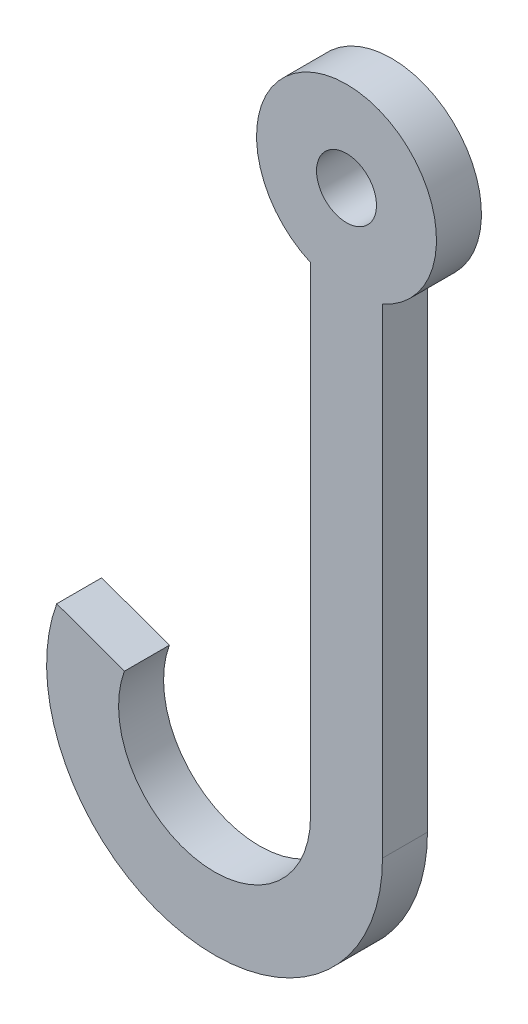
ISO-10303-21;
HEADER;
FILE_DESCRIPTION(('STEP AP214'),'2;1');
FILE_NAME('part.step','',(''),(''),'','','');
FILE_SCHEMA(('AUTOMOTIVE_DESIGN { 1 0 10303 214 1 1 1 1 }'));
ENDSEC;
DATA;
#1=APPLICATION_CONTEXT('core data for automotive mechanical design processes');
#2=APPLICATION_PROTOCOL_DEFINITION('international standard','automotive_design',2000,#1);
#3=PRODUCT_CONTEXT('',#1,'mechanical');
#4=PRODUCT('Part','Part','',(#3));
#5=PRODUCT_RELATED_PRODUCT_CATEGORY('part','',(#4));
#6=PRODUCT_DEFINITION_FORMATION('','',#4);
#7=PRODUCT_DEFINITION_CONTEXT('part definition',#1,'design');
#8=PRODUCT_DEFINITION('design','',#6,#7);
#9=PRODUCT_DEFINITION_SHAPE('','',#8);
#10=(LENGTH_UNIT() NAMED_UNIT(*) SI_UNIT(.MILLI.,.METRE.));
#11=(NAMED_UNIT(*) PLANE_ANGLE_UNIT() SI_UNIT($,.RADIAN.));
#12=(NAMED_UNIT(*) SI_UNIT($,.STERADIAN.) SOLID_ANGLE_UNIT());
#13=UNCERTAINTY_MEASURE_WITH_UNIT(LENGTH_MEASURE(1.E-05),#10,'distance_accuracy_value','');
#14=(GEOMETRIC_REPRESENTATION_CONTEXT(3) GLOBAL_UNCERTAINTY_ASSIGNED_CONTEXT((#13)) GLOBAL_UNIT_ASSIGNED_CONTEXT((#10,
#11,#12)) REPRESENTATION_CONTEXT('',''));
#15=CARTESIAN_POINT('',(0.,0.,0.));
#16=DIRECTION('',(0.,0.,1.));
#17=DIRECTION('',(1.,0.,0.));
#18=AXIS2_PLACEMENT_3D('',#15,#16,#17);
#19=CARTESIAN_POINT('',(0.,0.,4.7625));
#20=DIRECTION('',(0.,0.,1.));
#21=DIRECTION('',(1.,0.,0.));
#22=AXIS2_PLACEMENT_3D('',#19,#20,#21);
#23=PLANE('',#22);
#24=CARTESIAN_POINT('',(0.,0.,4.7625));
#25=DIRECTION('',(0.,0.,1.));
#26=DIRECTION('',(1.,0.,0.));
#27=AXIS2_PLACEMENT_3D('',#24,#25,#26);
#28=CIRCLE('',#27,9.525);
#29=CARTESIAN_POINT('',(3.81,-8.72980669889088,4.7625));
#30=VERTEX_POINT('',#29);
#31=CARTESIAN_POINT('',(-3.81,-8.72980669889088,4.7625));
#32=VERTEX_POINT('',#31);
#33=EDGE_CURVE('E133',#30,#32,#28,.T.);
#34=ORIENTED_EDGE('',*,*,#33,.T.);
#35=DIRECTION('',(0.,-1.,0.));
#36=VECTOR('',#35,1.);
#37=CARTESIAN_POINT('',(-3.81,-8.72980669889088,4.7625));
#38=LINE('',#37,#36);
#39=CARTESIAN_POINT('',(-3.81000000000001,-59.5298066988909,4.7625));
#40=VERTEX_POINT('',#39);
#41=EDGE_CURVE('E91',#32,#40,#38,.T.);
#42=ORIENTED_EDGE('',*,*,#41,.T.);
#43=CARTESIAN_POINT('',(-13.97,-59.5298066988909,4.7625));
#44=DIRECTION('',(0.,0.,-1.));
#45=DIRECTION('',(-1.,0.,0.));
#46=AXIS2_PLACEMENT_3D('',#43,#44,#45);
#47=CIRCLE('',#46,10.16);
#48=CARTESIAN_POINT('',(-23.5172770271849,-56.0548820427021,4.7625));
#49=VERTEX_POINT('',#48);
#50=EDGE_CURVE('E104',#40,#49,#47,.T.);
#51=ORIENTED_EDGE('',*,*,#50,.T.);
#52=DIRECTION('',(-0.939692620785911,0.342020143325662,0.));
#53=VECTOR('',#52,1.);
#54=CARTESIAN_POINT('',(-23.5172770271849,-56.0548820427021,4.7625));
#55=LINE('',#54,#53);
#56=CARTESIAN_POINT('',(-30.6777347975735,-53.4486885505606,4.7625));
#57=VERTEX_POINT('',#56);
#58=EDGE_CURVE('E98',#49,#57,#55,.T.);
#59=ORIENTED_EDGE('',*,*,#58,.T.);
#60=CARTESIAN_POINT('',(-13.97,-59.5298066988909,4.7625));
#61=DIRECTION('',(0.,0.,1.));
#62=DIRECTION('',(1.,0.,0.));
#63=AXIS2_PLACEMENT_3D('',#60,#61,#62);
#64=CIRCLE('',#63,17.78);
#65=CARTESIAN_POINT('',(3.81000000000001,-59.5298066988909,4.7625));
#66=VERTEX_POINT('',#65);
#67=EDGE_CURVE('E102',#57,#66,#64,.T.);
#68=ORIENTED_EDGE('',*,*,#67,.T.);
#69=DIRECTION('',(0.,1.,0.));
#70=VECTOR('',#69,1.);
#71=CARTESIAN_POINT('',(3.81,-8.72980669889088,4.7625));
#72=LINE('',#71,#70);
#73=EDGE_CURVE('E54',#66,#30,#72,.T.);
#74=ORIENTED_EDGE('',*,*,#73,.T.);
#75=EDGE_LOOP('',(#34,#42,#51,#59,#68,#74));
#76=FACE_BOUND('',#75,.T.);
#77=CARTESIAN_POINT('',(0.,0.,4.7625));
#78=DIRECTION('',(0.,0.,1.));
#79=DIRECTION('',(1.,0.,0.));
#80=AXIS2_PLACEMENT_3D('',#77,#78,#79);
#81=CIRCLE('',#80,3.175);
#82=CARTESIAN_POINT('',(-3.175,0.,4.7625));
#83=VERTEX_POINT('',#82);
#84=EDGE_CURVE('E126',#83,#83,#81,.T.);
#85=ORIENTED_EDGE('',*,*,#84,.F.);
#86=EDGE_LOOP('',(#85));
#87=FACE_BOUND('',#86,.T.);
#88=ADVANCED_FACE('F37',(#76,#87),#23,.T.);
#89=CARTESIAN_POINT('',(0.,0.,0.));
#90=DIRECTION('',(0.,0.,1.));
#91=DIRECTION('',(1.,0.,0.));
#92=AXIS2_PLACEMENT_3D('',#89,#90,#91);
#93=PLANE('',#92);
#94=CARTESIAN_POINT('',(0.,0.,0.));
#95=DIRECTION('',(0.,0.,1.));
#96=DIRECTION('',(1.,0.,0.));
#97=AXIS2_PLACEMENT_3D('',#94,#95,#96);
#98=CIRCLE('',#97,9.525);
#99=CARTESIAN_POINT('',(3.81,-8.72980669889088,0.));
#100=VERTEX_POINT('',#99);
#101=CARTESIAN_POINT('',(-3.81,-8.72980669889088,0.));
#102=VERTEX_POINT('',#101);
#103=EDGE_CURVE('E122',#100,#102,#98,.T.);
#104=ORIENTED_EDGE('',*,*,#103,.F.);
#105=DIRECTION('',(0.,1.,0.));
#106=VECTOR('',#105,1.);
#107=CARTESIAN_POINT('',(3.81,-8.72980669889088,0.));
#108=LINE('',#107,#106);
#109=CARTESIAN_POINT('',(3.81000000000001,-59.5298066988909,0.));
#110=VERTEX_POINT('',#109);
#111=EDGE_CURVE('E83',#110,#100,#108,.T.);
#112=ORIENTED_EDGE('',*,*,#111,.F.);
#113=CARTESIAN_POINT('',(-13.97,-59.5298066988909,0.));
#114=DIRECTION('',(0.,0.,1.));
#115=DIRECTION('',(1.,0.,0.));
#116=AXIS2_PLACEMENT_3D('',#113,#114,#115);
#117=CIRCLE('',#116,17.78);
#118=CARTESIAN_POINT('',(-30.6777347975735,-53.4486885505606,0.));
#119=VERTEX_POINT('',#118);
#120=EDGE_CURVE('E77',#119,#110,#117,.T.);
#121=ORIENTED_EDGE('',*,*,#120,.F.);
#122=DIRECTION('',(-0.939692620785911,0.342020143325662,0.));
#123=VECTOR('',#122,1.);
#124=CARTESIAN_POINT('',(-23.5172770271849,-56.0548820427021,0.));
#125=LINE('',#124,#123);
#126=CARTESIAN_POINT('',(-23.5172770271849,-56.0548820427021,0.));
#127=VERTEX_POINT('',#126);
#128=EDGE_CURVE('E112',#127,#119,#125,.T.);
#129=ORIENTED_EDGE('',*,*,#128,.F.);
#130=CARTESIAN_POINT('',(-13.97,-59.5298066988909,0.));
#131=DIRECTION('',(0.,0.,-1.));
#132=DIRECTION('',(-1.,0.,0.));
#133=AXIS2_PLACEMENT_3D('',#130,#131,#132);
#134=CIRCLE('',#133,10.16);
#135=CARTESIAN_POINT('',(-3.81000000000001,-59.5298066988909,0.));
#136=VERTEX_POINT('',#135);
#137=EDGE_CURVE('E128',#136,#127,#134,.T.);
#138=ORIENTED_EDGE('',*,*,#137,.F.);
#139=DIRECTION('',(0.,-1.,0.));
#140=VECTOR('',#139,1.);
#141=CARTESIAN_POINT('',(-3.81,-8.72980669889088,0.));
#142=LINE('',#141,#140);
#143=EDGE_CURVE('E125',#102,#136,#142,.T.);
#144=ORIENTED_EDGE('',*,*,#143,.F.);
#145=EDGE_LOOP('',(#104,#112,#121,#129,#138,#144));
#146=FACE_BOUND('',#145,.T.);
#147=CARTESIAN_POINT('',(0.,0.,0.));
#148=DIRECTION('',(0.,0.,1.));
#149=DIRECTION('',(1.,0.,0.));
#150=AXIS2_PLACEMENT_3D('',#147,#148,#149);
#151=CIRCLE('',#150,3.175);
#152=CARTESIAN_POINT('',(-3.175,0.,0.));
#153=VERTEX_POINT('',#152);
#154=EDGE_CURVE('E226',#153,#153,#151,.T.);
#155=ORIENTED_EDGE('',*,*,#154,.T.);
#156=EDGE_LOOP('',(#155));
#157=FACE_BOUND('',#156,.T.);
#158=ADVANCED_FACE('F142',(#146,#157),#93,.F.);
#159=CARTESIAN_POINT('',(0.,0.,4.7625));
#160=DIRECTION('',(0.,0.,-1.));
#161=DIRECTION('',(-1.,0.,0.));
#162=AXIS2_PLACEMENT_3D('',#159,#160,#161);
#163=CYLINDRICAL_SURFACE('',#162,9.525);
#164=ORIENTED_EDGE('',*,*,#103,.T.);
#165=DIRECTION('',(0.,0.,-1.));
#166=VECTOR('',#165,1.);
#167=CARTESIAN_POINT('',(-3.81,-8.72980669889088,4.7625));
#168=LINE('',#167,#166);
#169=EDGE_CURVE('E11',#32,#102,#168,.T.);
#170=ORIENTED_EDGE('',*,*,#169,.F.);
#171=ORIENTED_EDGE('',*,*,#33,.F.);
#172=DIRECTION('',(0.,0.,-1.));
#173=VECTOR('',#172,1.);
#174=CARTESIAN_POINT('',(3.81,-8.72980669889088,4.7625));
#175=LINE('',#174,#173);
#176=EDGE_CURVE('E118',#30,#100,#175,.T.);
#177=ORIENTED_EDGE('',*,*,#176,.T.);
#178=EDGE_LOOP('',(#164,#170,#171,#177));
#179=FACE_BOUND('',#178,.T.);
#180=ADVANCED_FACE('F39',(#179),#163,.T.);
#181=CARTESIAN_POINT('',(-3.81,-8.72980669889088,4.7625));
#182=DIRECTION('',(1.,0.,0.));
#183=DIRECTION('',(0.,1.,0.));
#184=AXIS2_PLACEMENT_3D('',#181,#182,#183);
#185=PLANE('',#184);
#186=ORIENTED_EDGE('',*,*,#143,.T.);
#187=DIRECTION('',(0.,0.,-1.));
#188=VECTOR('',#187,1.);
#189=CARTESIAN_POINT('',(-3.81000000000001,-59.5298066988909,4.7625));
#190=LINE('',#189,#188);
#191=EDGE_CURVE('E46',#40,#136,#190,.T.);
#192=ORIENTED_EDGE('',*,*,#191,.F.);
#193=ORIENTED_EDGE('',*,*,#41,.F.);
#194=ORIENTED_EDGE('',*,*,#169,.T.);
#195=EDGE_LOOP('',(#186,#192,#193,#194));
#196=FACE_BOUND('',#195,.T.);
#197=ADVANCED_FACE('F167',(#196),#185,.F.);
#198=CARTESIAN_POINT('',(-13.97,-59.5298066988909,4.7625));
#199=DIRECTION('',(0.,0.,-1.));
#200=DIRECTION('',(-1.,0.,0.));
#201=AXIS2_PLACEMENT_3D('',#198,#199,#200);
#202=CYLINDRICAL_SURFACE('',#201,10.16);
#203=ORIENTED_EDGE('',*,*,#137,.T.);
#204=DIRECTION('',(0.,0.,-1.));
#205=VECTOR('',#204,1.);
#206=CARTESIAN_POINT('',(-23.5172770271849,-56.0548820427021,4.7625));
#207=LINE('',#206,#205);
#208=EDGE_CURVE('E113',#49,#127,#207,.T.);
#209=ORIENTED_EDGE('',*,*,#208,.F.);
#210=ORIENTED_EDGE('',*,*,#50,.F.);
#211=ORIENTED_EDGE('',*,*,#191,.T.);
#212=EDGE_LOOP('',(#203,#209,#210,#211));
#213=FACE_BOUND('',#212,.T.);
#214=ADVANCED_FACE('F139',(#213),#202,.F.);
#215=CARTESIAN_POINT('',(-23.5172770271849,-56.0548820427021,4.7625));
#216=DIRECTION('',(-0.342020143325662,-0.939692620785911,0.));
#217=DIRECTION('',(0.939692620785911,-0.342020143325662,0.));
#218=AXIS2_PLACEMENT_3D('',#215,#216,#217);
#219=PLANE('',#218);
#220=ORIENTED_EDGE('',*,*,#128,.T.);
#221=DIRECTION('',(0.,0.,-1.));
#222=VECTOR('',#221,1.);
#223=CARTESIAN_POINT('',(-30.6777347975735,-53.4486885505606,4.7625));
#224=LINE('',#223,#222);
#225=EDGE_CURVE('E109',#57,#119,#224,.T.);
#226=ORIENTED_EDGE('',*,*,#225,.F.);
#227=ORIENTED_EDGE('',*,*,#58,.F.);
#228=ORIENTED_EDGE('',*,*,#208,.T.);
#229=EDGE_LOOP('',(#220,#226,#227,#228));
#230=FACE_BOUND('',#229,.T.);
#231=ADVANCED_FACE('F110',(#230),#219,.F.);
#232=CARTESIAN_POINT('',(-13.97,-59.5298066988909,4.7625));
#233=DIRECTION('',(0.,0.,-1.));
#234=DIRECTION('',(-1.,0.,0.));
#235=AXIS2_PLACEMENT_3D('',#232,#233,#234);
#236=CYLINDRICAL_SURFACE('',#235,17.78);
#237=ORIENTED_EDGE('',*,*,#120,.T.);
#238=DIRECTION('',(0.,0.,-1.));
#239=VECTOR('',#238,1.);
#240=CARTESIAN_POINT('',(3.81000000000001,-59.5298066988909,4.7625));
#241=LINE('',#240,#239);
#242=EDGE_CURVE('E114',#66,#110,#241,.T.);
#243=ORIENTED_EDGE('',*,*,#242,.F.);
#244=ORIENTED_EDGE('',*,*,#67,.F.);
#245=ORIENTED_EDGE('',*,*,#225,.T.);
#246=EDGE_LOOP('',(#237,#243,#244,#245));
#247=FACE_BOUND('',#246,.T.);
#248=ADVANCED_FACE('F116',(#247),#236,.T.);
#249=CARTESIAN_POINT('',(3.81,-8.72980669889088,4.7625));
#250=DIRECTION('',(-1.,0.,0.));
#251=DIRECTION('',(0.,-1.,0.));
#252=AXIS2_PLACEMENT_3D('',#249,#250,#251);
#253=PLANE('',#252);
#254=ORIENTED_EDGE('',*,*,#111,.T.);
#255=ORIENTED_EDGE('',*,*,#176,.F.);
#256=ORIENTED_EDGE('',*,*,#73,.F.);
#257=ORIENTED_EDGE('',*,*,#242,.T.);
#258=EDGE_LOOP('',(#254,#255,#256,#257));
#259=FACE_BOUND('',#258,.T.);
#260=ADVANCED_FACE('F147',(#259),#253,.F.);
#261=CARTESIAN_POINT('',(0.,0.,4.7625));
#262=DIRECTION('',(0.,0.,-1.));
#263=DIRECTION('',(-1.,0.,0.));
#264=AXIS2_PLACEMENT_3D('',#261,#262,#263);
#265=CYLINDRICAL_SURFACE('',#264,3.175);
#266=CARTESIAN_POINT('',(-3.175,0.,4.7625));
#267=CARTESIAN_POINT('',(-3.175,0.,4.712890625));
#268=CARTESIAN_POINT('',(-3.175,0.,4.66328125));
#269=CARTESIAN_POINT('',(-3.175,0.,4.5640625));
#270=CARTESIAN_POINT('',(-3.175,0.,4.514453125));
#271=CARTESIAN_POINT('',(-3.175,0.,4.415234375));
#272=CARTESIAN_POINT('',(-3.175,0.,4.365625));
#273=CARTESIAN_POINT('',(-3.175,0.,4.26640625));
#274=CARTESIAN_POINT('',(-3.175,0.,4.216796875));
#275=CARTESIAN_POINT('',(-3.175,0.,4.117578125));
#276=CARTESIAN_POINT('',(-3.175,0.,4.06796875));
#277=CARTESIAN_POINT('',(-3.175,0.,3.96875));
#278=CARTESIAN_POINT('',(-3.175,0.,3.919140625));
#279=CARTESIAN_POINT('',(-3.175,0.,3.819921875));
#280=CARTESIAN_POINT('',(-3.175,0.,3.7703125));
#281=CARTESIAN_POINT('',(-3.175,0.,3.67109375));
#282=CARTESIAN_POINT('',(-3.175,0.,3.621484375));
#283=CARTESIAN_POINT('',(-3.175,0.,3.522265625));
#284=CARTESIAN_POINT('',(-3.175,0.,3.47265625));
#285=CARTESIAN_POINT('',(-3.175,0.,3.3734375));
#286=CARTESIAN_POINT('',(-3.175,0.,3.323828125));
#287=CARTESIAN_POINT('',(-3.175,0.,3.224609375));
#288=CARTESIAN_POINT('',(-3.175,0.,3.175));
#289=CARTESIAN_POINT('',(-3.175,0.,3.07578125));
#290=CARTESIAN_POINT('',(-3.175,0.,3.026171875));
#291=CARTESIAN_POINT('',(-3.175,0.,2.926953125));
#292=CARTESIAN_POINT('',(-3.175,0.,2.87734375));
#293=CARTESIAN_POINT('',(-3.175,0.,2.778125));
#294=CARTESIAN_POINT('',(-3.175,0.,2.728515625));
#295=CARTESIAN_POINT('',(-3.175,0.,2.629296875));
#296=CARTESIAN_POINT('',(-3.175,0.,2.5796875));
#297=CARTESIAN_POINT('',(-3.175,0.,2.48046875));
#298=CARTESIAN_POINT('',(-3.175,0.,2.430859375));
#299=CARTESIAN_POINT('',(-3.175,0.,2.331640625));
#300=CARTESIAN_POINT('',(-3.175,0.,2.28203125));
#301=CARTESIAN_POINT('',(-3.175,0.,2.1828125));
#302=CARTESIAN_POINT('',(-3.175,0.,2.133203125));
#303=CARTESIAN_POINT('',(-3.175,0.,2.033984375));
#304=CARTESIAN_POINT('',(-3.175,0.,1.984375));
#305=CARTESIAN_POINT('',(-3.175,0.,1.88515625));
#306=CARTESIAN_POINT('',(-3.175,0.,1.835546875));
#307=CARTESIAN_POINT('',(-3.175,0.,1.736328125));
#308=CARTESIAN_POINT('',(-3.175,0.,1.68671875));
#309=CARTESIAN_POINT('',(-3.175,0.,1.5875));
#310=CARTESIAN_POINT('',(-3.175,0.,1.537890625));
#311=CARTESIAN_POINT('',(-3.175,0.,1.438671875));
#312=CARTESIAN_POINT('',(-3.175,0.,1.3890625));
#313=CARTESIAN_POINT('',(-3.175,0.,1.28984375));
#314=CARTESIAN_POINT('',(-3.175,0.,1.240234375));
#315=CARTESIAN_POINT('',(-3.175,0.,1.141015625));
#316=CARTESIAN_POINT('',(-3.175,0.,1.09140625));
#317=CARTESIAN_POINT('',(-3.175,0.,0.9921875));
#318=CARTESIAN_POINT('',(-3.175,0.,0.942578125));
#319=CARTESIAN_POINT('',(-3.175,0.,0.843359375));
#320=CARTESIAN_POINT('',(-3.175,0.,0.79375));
#321=CARTESIAN_POINT('',(-3.175,0.,0.69453125));
#322=CARTESIAN_POINT('',(-3.175,0.,0.644921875));
#323=CARTESIAN_POINT('',(-3.175,0.,0.545703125));
#324=CARTESIAN_POINT('',(-3.175,0.,0.49609375));
#325=CARTESIAN_POINT('',(-3.175,0.,0.396875));
#326=CARTESIAN_POINT('',(-3.175,0.,0.347265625));
#327=CARTESIAN_POINT('',(-3.175,0.,0.248046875));
#328=CARTESIAN_POINT('',(-3.175,0.,0.1984375));
#329=CARTESIAN_POINT('',(-3.175,0.,0.09921875));
#330=CARTESIAN_POINT('',(-3.175,0.,0.049609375));
#331=CARTESIAN_POINT('',(-3.175,0.,0.));
#332=B_SPLINE_CURVE_WITH_KNOTS('',3,(#266,#267,#268,#269,#270,#271,#272,#273,#274,#275,#276,
#277,#278,#279,#280,#281,#282,#283,#284,#285,#286,#287,#288,#289,#290,#291,#292,#293,#294,#295,
#296,#297,#298,#299,#300,#301,#302,#303,#304,#305,#306,#307,#308,#309,#310,#311,#312,#313,#314,
#315,#316,#317,#318,#319,#320,#321,#322,#323,#324,#325,#326,#327,#328,#329,#330,#331),
.UNSPECIFIED.,.F.,.F.,(4,2,2,2,2,2,2,2,2,2,2,2,2,2,2,2,2,2,2,2,2,2,2,2,2,2,2,2,2,2,2,2,4),(0.,
0.148828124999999,0.297656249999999,0.446484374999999,0.595312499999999,0.744140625,0.89296875,
1.041796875,1.190625,1.339453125,1.48828125,1.637109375,1.7859375,1.934765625,2.08359375,
2.232421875,2.38125,2.530078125,2.67890625,2.827734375,2.9765625,3.125390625,3.27421875,
3.423046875,3.571875,3.720703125,3.86953125,4.018359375,4.1671875,4.316015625,4.46484375,
4.613671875,4.7625),.UNSPECIFIED.);
#333=EDGE_CURVE('BSEAM149',#83,#153,#332,.T.);
#334=ORIENTED_EDGE('',*,*,#84,.T.);
#335=ORIENTED_EDGE('',*,*,#154,.F.);
#336=ORIENTED_EDGE('',*,*,#333,.T.);
#337=ORIENTED_EDGE('',*,*,#333,.F.);
#338=EDGE_LOOP('',(#334,#336,#335,#337));
#339=FACE_BOUND('',#338,.T.);
#340=ADVANCED_FACE('F149',(#339),#265,.F.);
#341=CLOSED_SHELL('',(#88,#158,#180,#197,#214,#231,#248,#260,#340));
#342=MANIFOLD_SOLID_BREP('B2',#341);
#343=ADVANCED_BREP_SHAPE_REPRESENTATION('',(#18,#342),#14);
#344=SHAPE_DEFINITION_REPRESENTATION(#9,#343);
ENDSEC;
END-ISO-10303-21;
